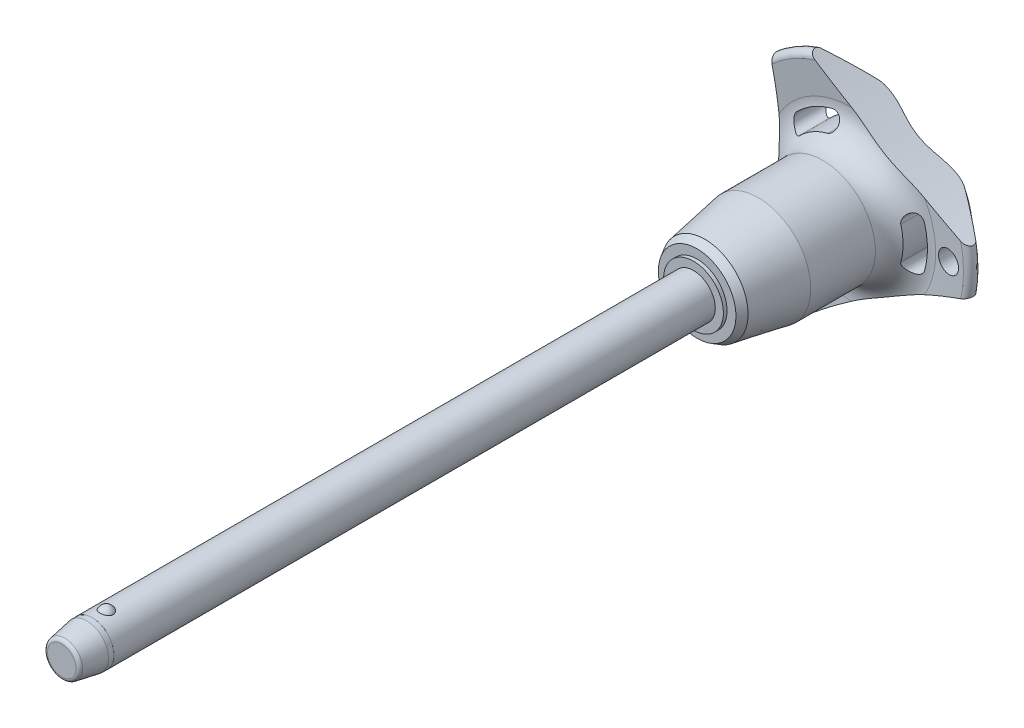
from build123d import *

# Parameters (mm, degrees)
SKETCH1_R           = 3
BOSS_EXTRUDE1_DEPTH = 80
SKETCH2_R           = 2.5
BOSS_EXTRUDE2_DEPTH = 26.7
BOSS_EXTRUDE3_START = 7
SKETCH1_2_R         = 3
BOSS_EXTRUDE3_DEPTH = 7
CHAMFER1_SIZE       = 3.5
CHAMFER1_SIZE2      = 0.617144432
FILLET1_R           = 0.5
SKETCH6_R           = 79.96
CUT_EXTRUDE1_DEPTH  = 110.252773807
CIRPATTERN1_COUNT   = 3
SKETCH7_R           = 1.5
CUT_EXTRUDE2_DEPTH  = 110.113366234
SKETCH8_R           = 3
SKETCH8_R_2         = 2.99
CUT_EXTRUDE3_DEPTH  = 4.2


with BuildPart() as part:
    # Sketch1 → Boss-Extrude1 (new body)
    with BuildSketch(Plane.XY):
        Circle(SKETCH1_R)
    extrude(amount=-BOSS_EXTRUDE1_DEPTH)

    # Sketch2 → Boss-Extrude2 (add)
    with BuildSketch(Plane(origin=(0, 0, -80), x_dir=(-1, 0, 0), z_dir=(0, 0, -1))):
        Circle(SKETCH2_R)
    extrude(amount=BOSS_EXTRUDE2_DEPTH)

    # Sketch3 → Revolve1 (revolve)
    with BuildSketch(Plane(origin=(0, 0, 0), x_dir=(0, 0, -1), z_dir=(1, 0, 0))):
        with BuildLine():
            Line((-0.866025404, 3.5), (-0.866025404, 1.5))
            ThreePointArc((-0.866025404, 1.5), (0.133974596, 2.5), (-0.866025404, 3.5))
        make_face()
        with BuildLine():
            Line((-0.866025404, -1.5), (-0.866025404, -3.5))
            ThreePointArc((-0.866025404, -3.5), (0.133974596, -2.5), (-0.866025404, -1.5))
        make_face()
    revolve(axis=Axis((0, -1.5, 0.866025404), (0, 1, 0)))

    # Sketch1_2 → Boss-Extrude3 (add)
    with BuildSketch(Plane.XY.offset(BOSS_EXTRUDE3_START)):
        Circle(SKETCH1_2_R)
    extrude(amount=-BOSS_EXTRUDE3_DEPTH)

    # Chamfer1
    chamfer1_edges = [part.edges().sort_by_distance(p)[0] for p in [
        (-3, 0, 7),
    ]]
    chamfer1_side = [part.faces().sort_by_distance(p)[0] for p in [
        (-3, 0, -36.5),
    ]]
    chamfer(chamfer1_edges, length=CHAMFER1_SIZE, length2=CHAMFER1_SIZE2, reference=chamfer1_side[0])

    # Fillet1
    fillet1_edges = [part.edges().sort_by_distance(p)[0] for p in [
        (-2.382855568, 0, 7),
        (2.5, 0, -106.7),
    ]]
    fillet(fillet1_edges, radius=FILLET1_R)

    # Sketch4 → Revolve2 (revolve)
    with BuildSketch(Plane(origin=(0, 0, 0), x_dir=(0, 0, -1), z_dir=(1, 0, 0)), mode=Mode.PRIVATE) as revolve2_sk:
        Polygon((80, 0), (80, 4.118359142), (80.5, 4.118359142), (80.5, 5.343400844), (81.560917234, 5.955921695), (88.9, 7.25), (97.8, 7.25), (97.8, 0), align=None)
    revolve(revolve2_sk.sketch.rotate(Axis((0, 0, -97.8), (0, 0, 1)), 90), axis=Axis((0, 0, -97.8), (0, 0, 1)))

    # Sketch5 → Revolve3 (revolve)
    with BuildSketch(Plane(origin=(0, 0, 0), x_dir=(0, 0, -1), z_dir=(1, 0, 0)), mode=Mode.PRIVATE) as revolve3_sk:
        with BuildLine():
            Line((101.78715932, 11.570250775), (101.452568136, 15.735949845))
            ThreePointArc((101.452568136, 15.735949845), (101.946485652, 16.540188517), (102.862835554, 16.314230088))
            Line((102.862835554, 16.314230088), (106.326414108, 12.186497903))
            ThreePointArc((106.326414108, 12.186497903), (106.7, 11.109282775), (106.261488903, 10.056825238))
            ThreePointArc((106.261488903, 10.056825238), (103.289873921, 5.413681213), (102.25, 0))
            Line((102.25, 0), (97.8, 0))
            Line((97.8, 0), (97.8, 7.25))
            ThreePointArc((97.8, 7.25), (100.739473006, 8.537160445), (101.78715932, 11.570250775))
        make_face()
    revolve(revolve3_sk.sketch.rotate(Axis((0, 0, -102.25), (0, 0, 1)), 90), axis=Axis((0, 0, -102.25), (0, 0, 1)))

    # Sketch6 → Cut-Extrude1 (cut, through all)
    with BuildSketch(Plane.XY):
        with Locations((-89.76, 0)):
            Circle(SKETCH6_R)
        with BuildLine():
            ThreePointArc((10.099921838, -2.834717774), (10.490188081, 0), (10.099921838, 2.834717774))
            ThreePointArc((10.099921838, 2.834717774), (8.768180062, 3.582738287), (8.020159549, 2.250996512))
            ThreePointArc((8.020159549, 2.250996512), (8.330062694, 0), (8.020159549, -2.250996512))
            ThreePointArc((8.020159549, -2.250996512), (8.768180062, -3.582738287), (10.099921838, -2.834717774))
        make_face()
    cut_extrude1 = extrude(amount=-CUT_EXTRUDE1_DEPTH, mode=Mode.SUBTRACT)

    # CirPattern1: Cut-Extrude1 ×3 about axis
    cirpattern1_axis = Axis((0, 0, 0), (0, 0, 1))
    for i in range(1, CIRPATTERN1_COUNT):
        add(cut_extrude1.rotate(cirpattern1_axis, i * 360 / CIRPATTERN1_COUNT), mode=Mode.SUBTRACT)

    # Sketch7 → Cut-Extrude2 (cut, through all)
    with BuildSketch(Plane.XY):
        with Locations(Location((13.490188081, 0, 0), (0, 0, 225.221865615))):
            Circle(SKETCH7_R)
    extrude(amount=-CUT_EXTRUDE2_DEPTH, mode=Mode.SUBTRACT)

    # Sketch8 → Cut-Extrude3 (cut)
    with BuildSketch(Plane.XY.offset(7)):
        Circle(SKETCH8_R)
        Circle(SKETCH8_R_2, mode=Mode.SUBTRACT)
    extrude(amount=-CUT_EXTRUDE3_DEPTH, mode=Mode.SUBTRACT)


solid = part.part
